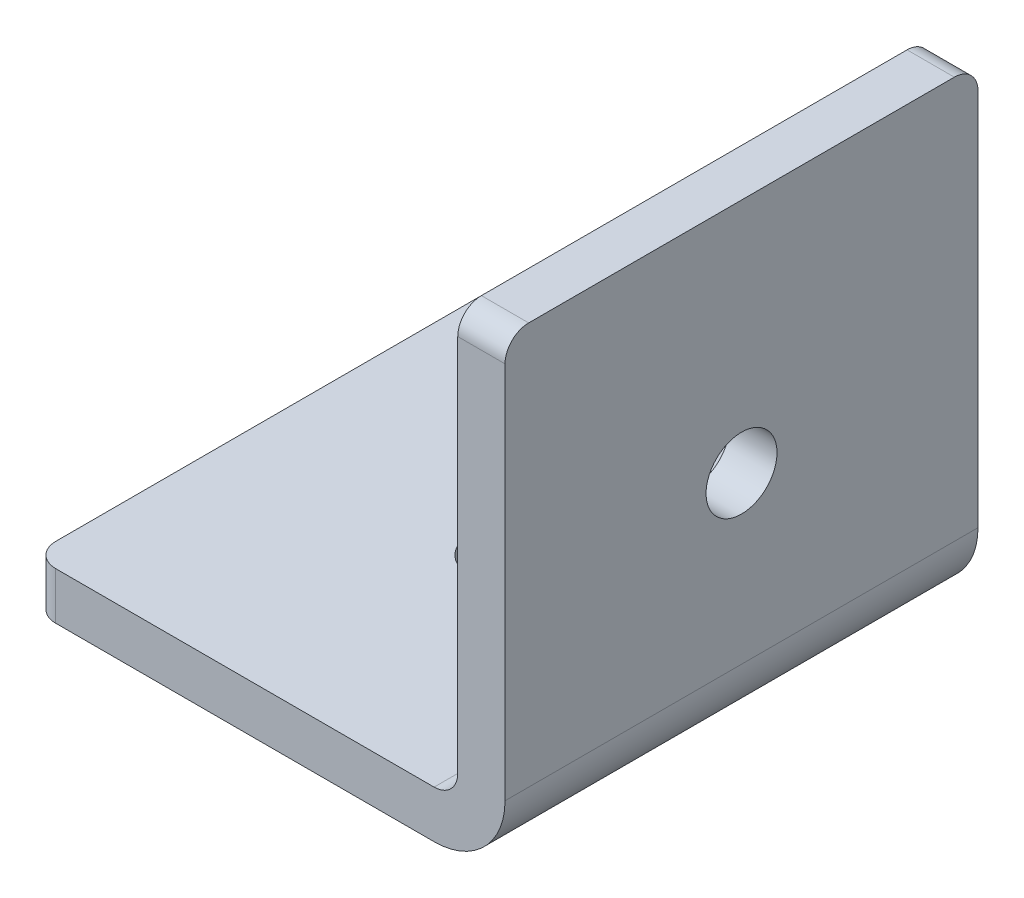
ISO-10303-21;
HEADER;
FILE_DESCRIPTION(('STEP AP214'),'2;1');
FILE_NAME('part.step','',(''),(''),'','','');
FILE_SCHEMA(('AUTOMOTIVE_DESIGN { 1 0 10303 214 1 1 1 1 }'));
ENDSEC;
DATA;
#1=APPLICATION_CONTEXT('core data for automotive mechanical design processes');
#2=APPLICATION_PROTOCOL_DEFINITION('international standard','automotive_design',2000,#1);
#3=PRODUCT_CONTEXT('',#1,'mechanical');
#4=PRODUCT('Part','Part','',(#3));
#5=PRODUCT_RELATED_PRODUCT_CATEGORY('part','',(#4));
#6=PRODUCT_DEFINITION_FORMATION('','',#4);
#7=PRODUCT_DEFINITION_CONTEXT('part definition',#1,'design');
#8=PRODUCT_DEFINITION('design','',#6,#7);
#9=PRODUCT_DEFINITION_SHAPE('','',#8);
#10=(LENGTH_UNIT() NAMED_UNIT(*) SI_UNIT(.MILLI.,.METRE.));
#11=(NAMED_UNIT(*) PLANE_ANGLE_UNIT() SI_UNIT($,.RADIAN.));
#12=(NAMED_UNIT(*) SI_UNIT($,.STERADIAN.) SOLID_ANGLE_UNIT());
#13=UNCERTAINTY_MEASURE_WITH_UNIT(LENGTH_MEASURE(1.E-05),#10,'distance_accuracy_value','');
#14=(GEOMETRIC_REPRESENTATION_CONTEXT(3) GLOBAL_UNCERTAINTY_ASSIGNED_CONTEXT((#13)) GLOBAL_UNIT_ASSIGNED_CONTEXT((#10,
#11,#12)) REPRESENTATION_CONTEXT('',''));
#15=CARTESIAN_POINT('',(0.,0.,0.));
#16=DIRECTION('',(0.,0.,1.));
#17=DIRECTION('',(1.,0.,0.));
#18=AXIS2_PLACEMENT_3D('',#15,#16,#17);
#19=CARTESIAN_POINT('',(40.,0.,40.));
#20=DIRECTION('',(-1.,0.,0.));
#21=DIRECTION('',(0.,0.,1.));
#22=AXIS2_PLACEMENT_3D('',#19,#20,#21);
#23=PLANE('',#22);
#24=CARTESIAN_POINT('',(40.,20.,20.));
#25=DIRECTION('',(1.,0.,0.));
#26=DIRECTION('',(0.,0.,-1.));
#27=AXIS2_PLACEMENT_3D('',#24,#25,#26);
#28=CIRCLE('',#27,3.);
#29=CARTESIAN_POINT('',(40.,20.,17.));
#30=VERTEX_POINT('',#29);
#31=EDGE_CURVE('E204',#30,#30,#28,.T.);
#32=ORIENTED_EDGE('',*,*,#31,.F.);
#33=EDGE_LOOP('',(#32));
#34=FACE_BOUND('',#33,.T.);
#35=DIRECTION('',(0.,1.,0.));
#36=VECTOR('',#35,1.);
#37=CARTESIAN_POINT('',(40.,0.,40.));
#38=LINE('',#37,#36);
#39=CARTESIAN_POINT('',(40.,6.,40.));
#40=VERTEX_POINT('',#39);
#41=CARTESIAN_POINT('',(40.,38.,40.));
#42=VERTEX_POINT('',#41);
#43=EDGE_CURVE('E193',#40,#42,#38,.T.);
#44=ORIENTED_EDGE('',*,*,#43,.F.);
#45=DIRECTION('',(0.,0.,-1.));
#46=VECTOR('',#45,1.);
#47=CARTESIAN_POINT('',(40.,6.,40.));
#48=LINE('',#47,#46);
#49=CARTESIAN_POINT('',(40.,6.,0.));
#50=VERTEX_POINT('',#49);
#51=EDGE_CURVE('E184',#40,#50,#48,.T.);
#52=ORIENTED_EDGE('',*,*,#51,.T.);
#53=DIRECTION('',(0.,1.,0.));
#54=VECTOR('',#53,1.);
#55=CARTESIAN_POINT('',(40.,0.,0.));
#56=LINE('',#55,#54);
#57=CARTESIAN_POINT('',(40.,38.,0.));
#58=VERTEX_POINT('',#57);
#59=EDGE_CURVE('E191',#50,#58,#56,.T.);
#60=ORIENTED_EDGE('',*,*,#59,.T.);
#61=CARTESIAN_POINT('',(40.,38.,2.));
#62=DIRECTION('',(-1.,0.,0.));
#63=DIRECTION('',(0.,0.,1.));
#64=AXIS2_PLACEMENT_3D('',#61,#62,#63);
#65=CIRCLE('',#64,2.);
#66=CARTESIAN_POINT('',(40.,40.,2.));
#67=VERTEX_POINT('',#66);
#68=EDGE_CURVE('E145',#58,#67,#65,.F.);
#69=ORIENTED_EDGE('',*,*,#68,.T.);
#70=DIRECTION('',(0.,0.,-1.));
#71=VECTOR('',#70,1.);
#72=CARTESIAN_POINT('',(40.,40.,40.));
#73=LINE('',#72,#71);
#74=CARTESIAN_POINT('',(40.,40.,38.));
#75=VERTEX_POINT('',#74);
#76=EDGE_CURVE('E139',#75,#67,#73,.T.);
#77=ORIENTED_EDGE('',*,*,#76,.F.);
#78=CARTESIAN_POINT('',(40.,38.,38.));
#79=DIRECTION('',(-1.,0.,0.));
#80=DIRECTION('',(0.,0.,1.));
#81=AXIS2_PLACEMENT_3D('',#78,#79,#80);
#82=CIRCLE('',#81,2.);
#83=EDGE_CURVE('E144',#75,#42,#82,.F.);
#84=ORIENTED_EDGE('',*,*,#83,.T.);
#85=EDGE_LOOP('',(#44,#52,#60,#69,#77,#84));
#86=FACE_BOUND('',#85,.T.);
#87=ADVANCED_FACE('F28',(#34,#86),#23,.F.);
#88=CARTESIAN_POINT('',(36.,40.,40.));
#89=DIRECTION('',(0.,1.,0.));
#90=DIRECTION('',(0.,0.,1.));
#91=AXIS2_PLACEMENT_3D('',#88,#89,#90);
#92=PLANE('',#91);
#93=DIRECTION('',(0.,0.,-1.));
#94=VECTOR('',#93,1.);
#95=CARTESIAN_POINT('',(36.,40.,40.));
#96=LINE('',#95,#94);
#97=CARTESIAN_POINT('',(36.,40.,38.));
#98=VERTEX_POINT('',#97);
#99=CARTESIAN_POINT('',(36.,40.,2.));
#100=VERTEX_POINT('',#99);
#101=EDGE_CURVE('E121',#98,#100,#96,.T.);
#102=ORIENTED_EDGE('',*,*,#101,.F.);
#103=DIRECTION('',(1.,0.,0.));
#104=VECTOR('',#103,1.);
#105=CARTESIAN_POINT('',(36.,40.,38.));
#106=LINE('',#105,#104);
#107=EDGE_CURVE('E135',#98,#75,#106,.T.);
#108=ORIENTED_EDGE('',*,*,#107,.T.);
#109=ORIENTED_EDGE('',*,*,#76,.T.);
#110=DIRECTION('',(1.,0.,0.));
#111=VECTOR('',#110,1.);
#112=CARTESIAN_POINT('',(36.,40.,2.));
#113=LINE('',#112,#111);
#114=EDGE_CURVE('E138',#67,#100,#113,.F.);
#115=ORIENTED_EDGE('',*,*,#114,.T.);
#116=EDGE_LOOP('',(#102,#108,#109,#115));
#117=FACE_BOUND('',#116,.T.);
#118=ADVANCED_FACE('F133',(#117),#92,.T.);
#119=CARTESIAN_POINT('',(36.,0.,40.));
#120=DIRECTION('',(-1.,0.,0.));
#121=DIRECTION('',(0.,0.,1.));
#122=AXIS2_PLACEMENT_3D('',#119,#120,#121);
#123=PLANE('',#122);
#124=CARTESIAN_POINT('',(36.,20.,20.));
#125=DIRECTION('',(-1.,0.,0.));
#126=DIRECTION('',(0.,0.,1.));
#127=AXIS2_PLACEMENT_3D('',#124,#125,#126);
#128=CIRCLE('',#127,3.);
#129=CARTESIAN_POINT('',(36.,20.,23.));
#130=VERTEX_POINT('',#129);
#131=EDGE_CURVE('E31',#130,#130,#128,.T.);
#132=ORIENTED_EDGE('',*,*,#131,.F.);
#133=EDGE_LOOP('',(#132));
#134=FACE_BOUND('',#133,.T.);
#135=DIRECTION('',(0.,1.,0.));
#136=VECTOR('',#135,1.);
#137=CARTESIAN_POINT('',(36.,0.,40.));
#138=LINE('',#137,#136);
#139=CARTESIAN_POINT('',(36.,6.,40.));
#140=VERTEX_POINT('',#139);
#141=CARTESIAN_POINT('',(36.,38.,40.));
#142=VERTEX_POINT('',#141);
#143=EDGE_CURVE('E124',#140,#142,#138,.T.);
#144=ORIENTED_EDGE('',*,*,#143,.T.);
#145=CARTESIAN_POINT('',(36.,38.,38.));
#146=DIRECTION('',(-1.,0.,0.));
#147=DIRECTION('',(0.,0.,1.));
#148=AXIS2_PLACEMENT_3D('',#145,#146,#147);
#149=CIRCLE('',#148,2.);
#150=EDGE_CURVE('E118',#142,#98,#149,.T.);
#151=ORIENTED_EDGE('',*,*,#150,.T.);
#152=ORIENTED_EDGE('',*,*,#101,.T.);
#153=CARTESIAN_POINT('',(36.,38.,2.));
#154=DIRECTION('',(-1.,0.,0.));
#155=DIRECTION('',(0.,0.,1.));
#156=AXIS2_PLACEMENT_3D('',#153,#154,#155);
#157=CIRCLE('',#156,2.);
#158=CARTESIAN_POINT('',(36.,38.,0.));
#159=VERTEX_POINT('',#158);
#160=EDGE_CURVE('E129',#100,#159,#157,.T.);
#161=ORIENTED_EDGE('',*,*,#160,.T.);
#162=DIRECTION('',(0.,1.,0.));
#163=VECTOR('',#162,1.);
#164=CARTESIAN_POINT('',(36.,0.,0.));
#165=LINE('',#164,#163);
#166=CARTESIAN_POINT('',(36.,6.,0.));
#167=VERTEX_POINT('',#166);
#168=EDGE_CURVE('E199',#167,#159,#165,.T.);
#169=ORIENTED_EDGE('',*,*,#168,.F.);
#170=DIRECTION('',(0.,0.,-1.));
#171=VECTOR('',#170,1.);
#172=CARTESIAN_POINT('',(36.,6.,40.));
#173=LINE('',#172,#171);
#174=EDGE_CURVE('E156',#167,#140,#173,.F.);
#175=ORIENTED_EDGE('',*,*,#174,.T.);
#176=EDGE_LOOP('',(#144,#151,#152,#161,#169,#175));
#177=FACE_BOUND('',#176,.T.);
#178=ADVANCED_FACE('F120',(#134,#177),#123,.T.);
#179=CARTESIAN_POINT('',(0.,4.,40.));
#180=DIRECTION('',(0.,1.,0.));
#181=DIRECTION('',(0.,0.,1.));
#182=AXIS2_PLACEMENT_3D('',#179,#180,#181);
#183=PLANE('',#182);
#184=CARTESIAN_POINT('',(20.,4.,20.));
#185=DIRECTION('',(0.,1.,0.));
#186=DIRECTION('',(0.,0.,1.));
#187=AXIS2_PLACEMENT_3D('',#184,#185,#186);
#188=CIRCLE('',#187,3.);
#189=CARTESIAN_POINT('',(20.,4.,23.));
#190=VERTEX_POINT('',#189);
#191=EDGE_CURVE('E274',#190,#190,#188,.T.);
#192=ORIENTED_EDGE('',*,*,#191,.F.);
#193=EDGE_LOOP('',(#192));
#194=FACE_BOUND('',#193,.T.);
#195=DIRECTION('',(0.,0.,-1.));
#196=VECTOR('',#195,1.);
#197=CARTESIAN_POINT('',(0.,4.,40.));
#198=LINE('',#197,#196);
#199=CARTESIAN_POINT('',(0.,4.,38.));
#200=VERTEX_POINT('',#199);
#201=CARTESIAN_POINT('',(0.,4.,2.));
#202=VERTEX_POINT('',#201);
#203=EDGE_CURVE('E140',#200,#202,#198,.T.);
#204=ORIENTED_EDGE('',*,*,#203,.F.);
#205=CARTESIAN_POINT('',(2.,4.,38.));
#206=DIRECTION('',(0.,1.,0.));
#207=DIRECTION('',(0.,0.,1.));
#208=AXIS2_PLACEMENT_3D('',#205,#206,#207);
#209=CIRCLE('',#208,2.);
#210=CARTESIAN_POINT('',(2.,4.,40.));
#211=VERTEX_POINT('',#210);
#212=EDGE_CURVE('E174',#200,#211,#209,.T.);
#213=ORIENTED_EDGE('',*,*,#212,.T.);
#214=DIRECTION('',(1.,0.,0.));
#215=VECTOR('',#214,1.);
#216=CARTESIAN_POINT('',(0.,4.,40.));
#217=LINE('',#216,#215);
#218=CARTESIAN_POINT('',(34.,4.,40.));
#219=VERTEX_POINT('',#218);
#220=EDGE_CURVE('E214',#211,#219,#217,.T.);
#221=ORIENTED_EDGE('',*,*,#220,.T.);
#222=DIRECTION('',(0.,0.,-1.));
#223=VECTOR('',#222,1.);
#224=CARTESIAN_POINT('',(34.,4.,40.));
#225=LINE('',#224,#223);
#226=CARTESIAN_POINT('',(34.,4.,0.));
#227=VERTEX_POINT('',#226);
#228=EDGE_CURVE('E169',#219,#227,#225,.T.);
#229=ORIENTED_EDGE('',*,*,#228,.T.);
#230=DIRECTION('',(1.,0.,0.));
#231=VECTOR('',#230,1.);
#232=CARTESIAN_POINT('',(0.,4.,0.));
#233=LINE('',#232,#231);
#234=CARTESIAN_POINT('',(2.,4.,0.));
#235=VERTEX_POINT('',#234);
#236=EDGE_CURVE('E201',#235,#227,#233,.T.);
#237=ORIENTED_EDGE('',*,*,#236,.F.);
#238=CARTESIAN_POINT('',(2.,4.,2.));
#239=DIRECTION('',(0.,1.,0.));
#240=DIRECTION('',(0.,0.,1.));
#241=AXIS2_PLACEMENT_3D('',#238,#239,#240);
#242=CIRCLE('',#241,2.);
#243=EDGE_CURVE('E172',#235,#202,#242,.T.);
#244=ORIENTED_EDGE('',*,*,#243,.T.);
#245=EDGE_LOOP('',(#204,#213,#221,#229,#237,#244));
#246=FACE_BOUND('',#245,.T.);
#247=ADVANCED_FACE('F234',(#194,#246),#183,.T.);
#248=CARTESIAN_POINT('',(0.,0.,40.));
#249=DIRECTION('',(-1.,0.,0.));
#250=DIRECTION('',(0.,0.,1.));
#251=AXIS2_PLACEMENT_3D('',#248,#249,#250);
#252=PLANE('',#251);
#253=DIRECTION('',(0.,0.,-1.));
#254=VECTOR('',#253,1.);
#255=CARTESIAN_POINT('',(0.,0.,40.));
#256=LINE('',#255,#254);
#257=CARTESIAN_POINT('',(0.,0.,38.));
#258=VERTEX_POINT('',#257);
#259=CARTESIAN_POINT('',(0.,0.,2.));
#260=VERTEX_POINT('',#259);
#261=EDGE_CURVE('E219',#258,#260,#256,.T.);
#262=ORIENTED_EDGE('',*,*,#261,.F.);
#263=DIRECTION('',(0.,1.,0.));
#264=VECTOR('',#263,1.);
#265=CARTESIAN_POINT('',(0.,0.,38.));
#266=LINE('',#265,#264);
#267=EDGE_CURVE('E166',#258,#200,#266,.T.);
#268=ORIENTED_EDGE('',*,*,#267,.T.);
#269=ORIENTED_EDGE('',*,*,#203,.T.);
#270=DIRECTION('',(0.,1.,0.));
#271=VECTOR('',#270,1.);
#272=CARTESIAN_POINT('',(0.,0.,2.));
#273=LINE('',#272,#271);
#274=EDGE_CURVE('E164',#202,#260,#273,.F.);
#275=ORIENTED_EDGE('',*,*,#274,.T.);
#276=EDGE_LOOP('',(#262,#268,#269,#275));
#277=FACE_BOUND('',#276,.T.);
#278=ADVANCED_FACE('F247',(#277),#252,.T.);
#279=CARTESIAN_POINT('',(0.,0.,40.));
#280=DIRECTION('',(0.,1.,0.));
#281=DIRECTION('',(0.,0.,1.));
#282=AXIS2_PLACEMENT_3D('',#279,#280,#281);
#283=PLANE('',#282);
#284=CARTESIAN_POINT('',(20.,0.,20.));
#285=DIRECTION('',(0.,1.,0.));
#286=DIRECTION('',(0.,0.,1.));
#287=AXIS2_PLACEMENT_3D('',#284,#285,#286);
#288=CIRCLE('',#287,3.);
#289=CARTESIAN_POINT('',(20.,0.,23.));
#290=VERTEX_POINT('',#289);
#291=EDGE_CURVE('E272',#290,#290,#288,.T.);
#292=ORIENTED_EDGE('',*,*,#291,.T.);
#293=EDGE_LOOP('',(#292));
#294=FACE_BOUND('',#293,.T.);
#295=DIRECTION('',(1.,0.,0.));
#296=VECTOR('',#295,1.);
#297=CARTESIAN_POINT('',(0.,0.,0.));
#298=LINE('',#297,#296);
#299=CARTESIAN_POINT('',(2.,0.,0.));
#300=VERTEX_POINT('',#299);
#301=CARTESIAN_POINT('',(34.,0.,0.));
#302=VERTEX_POINT('',#301);
#303=EDGE_CURVE('E210',#300,#302,#298,.T.);
#304=ORIENTED_EDGE('',*,*,#303,.T.);
#305=DIRECTION('',(0.,0.,-1.));
#306=VECTOR('',#305,1.);
#307=CARTESIAN_POINT('',(34.,0.,40.));
#308=LINE('',#307,#306);
#309=CARTESIAN_POINT('',(34.,0.,40.));
#310=VERTEX_POINT('',#309);
#311=EDGE_CURVE('E36',#302,#310,#308,.F.);
#312=ORIENTED_EDGE('',*,*,#311,.T.);
#313=DIRECTION('',(1.,0.,0.));
#314=VECTOR('',#313,1.);
#315=CARTESIAN_POINT('',(0.,0.,40.));
#316=LINE('',#315,#314);
#317=CARTESIAN_POINT('',(2.,0.,40.));
#318=VERTEX_POINT('',#317);
#319=EDGE_CURVE('E217',#318,#310,#316,.T.);
#320=ORIENTED_EDGE('',*,*,#319,.F.);
#321=CARTESIAN_POINT('',(2.,0.,38.));
#322=DIRECTION('',(0.,1.,0.));
#323=DIRECTION('',(0.,0.,1.));
#324=AXIS2_PLACEMENT_3D('',#321,#322,#323);
#325=CIRCLE('',#324,2.);
#326=EDGE_CURVE('E178',#318,#258,#325,.F.);
#327=ORIENTED_EDGE('',*,*,#326,.T.);
#328=ORIENTED_EDGE('',*,*,#261,.T.);
#329=CARTESIAN_POINT('',(2.,0.,2.));
#330=DIRECTION('',(0.,1.,0.));
#331=DIRECTION('',(0.,0.,1.));
#332=AXIS2_PLACEMENT_3D('',#329,#330,#331);
#333=CIRCLE('',#332,2.);
#334=EDGE_CURVE('E176',#260,#300,#333,.F.);
#335=ORIENTED_EDGE('',*,*,#334,.T.);
#336=EDGE_LOOP('',(#304,#312,#320,#327,#328,#335));
#337=FACE_BOUND('',#336,.T.);
#338=ADVANCED_FACE('F244',(#294,#337),#283,.F.);
#339=CARTESIAN_POINT('',(40.,40.,40.));
#340=DIRECTION('',(0.,0.,-1.));
#341=DIRECTION('',(-1.,0.,0.));
#342=AXIS2_PLACEMENT_3D('',#339,#340,#341);
#343=PLANE('',#342);
#344=ORIENTED_EDGE('',*,*,#319,.T.);
#345=CARTESIAN_POINT('',(34.,6.,40.));
#346=DIRECTION('',(0.,0.,-1.));
#347=DIRECTION('',(-1.,0.,0.));
#348=AXIS2_PLACEMENT_3D('',#345,#346,#347);
#349=CIRCLE('',#348,6.);
#350=EDGE_CURVE('E11',#310,#40,#349,.F.);
#351=ORIENTED_EDGE('',*,*,#350,.T.);
#352=ORIENTED_EDGE('',*,*,#43,.T.);
#353=DIRECTION('',(1.,0.,0.));
#354=VECTOR('',#353,1.);
#355=CARTESIAN_POINT('',(36.,38.,40.));
#356=LINE('',#355,#354);
#357=EDGE_CURVE('E154',#42,#142,#356,.F.);
#358=ORIENTED_EDGE('',*,*,#357,.T.);
#359=ORIENTED_EDGE('',*,*,#143,.F.);
#360=CARTESIAN_POINT('',(34.,6.,40.));
#361=DIRECTION('',(0.,0.,-1.));
#362=DIRECTION('',(-1.,0.,0.));
#363=AXIS2_PLACEMENT_3D('',#360,#361,#362);
#364=CIRCLE('',#363,2.);
#365=EDGE_CURVE('E182',#140,#219,#364,.T.);
#366=ORIENTED_EDGE('',*,*,#365,.T.);
#367=ORIENTED_EDGE('',*,*,#220,.F.);
#368=DIRECTION('',(0.,1.,0.));
#369=VECTOR('',#368,1.);
#370=CARTESIAN_POINT('',(2.,0.,40.));
#371=LINE('',#370,#369);
#372=EDGE_CURVE('E152',#211,#318,#371,.F.);
#373=ORIENTED_EDGE('',*,*,#372,.T.);
#374=EDGE_LOOP('',(#344,#351,#352,#358,#359,#366,#367,#373));
#375=FACE_BOUND('',#374,.T.);
#376=ADVANCED_FACE('F238',(#375),#343,.F.);
#377=CARTESIAN_POINT('',(40.,40.,0.));
#378=DIRECTION('',(0.,0.,-1.));
#379=DIRECTION('',(-1.,0.,0.));
#380=AXIS2_PLACEMENT_3D('',#377,#378,#379);
#381=PLANE('',#380);
#382=ORIENTED_EDGE('',*,*,#59,.F.);
#383=CARTESIAN_POINT('',(34.,6.,0.));
#384=DIRECTION('',(0.,0.,-1.));
#385=DIRECTION('',(-1.,0.,0.));
#386=AXIS2_PLACEMENT_3D('',#383,#384,#385);
#387=CIRCLE('',#386,6.);
#388=EDGE_CURVE('E50',#50,#302,#387,.T.);
#389=ORIENTED_EDGE('',*,*,#388,.T.);
#390=ORIENTED_EDGE('',*,*,#303,.F.);
#391=DIRECTION('',(0.,1.,0.));
#392=VECTOR('',#391,1.);
#393=CARTESIAN_POINT('',(2.,40.,0.));
#394=LINE('',#393,#392);
#395=EDGE_CURVE('E128',#300,#235,#394,.T.);
#396=ORIENTED_EDGE('',*,*,#395,.T.);
#397=ORIENTED_EDGE('',*,*,#236,.T.);
#398=CARTESIAN_POINT('',(34.,6.,0.));
#399=DIRECTION('',(0.,0.,-1.));
#400=DIRECTION('',(-1.,0.,0.));
#401=AXIS2_PLACEMENT_3D('',#398,#399,#400);
#402=CIRCLE('',#401,2.);
#403=EDGE_CURVE('E180',#227,#167,#402,.F.);
#404=ORIENTED_EDGE('',*,*,#403,.T.);
#405=ORIENTED_EDGE('',*,*,#168,.T.);
#406=DIRECTION('',(1.,0.,0.));
#407=VECTOR('',#406,1.);
#408=CARTESIAN_POINT('',(40.,38.,0.));
#409=LINE('',#408,#407);
#410=EDGE_CURVE('E161',#159,#58,#409,.T.);
#411=ORIENTED_EDGE('',*,*,#410,.T.);
#412=EDGE_LOOP('',(#382,#389,#390,#396,#397,#404,#405,#411));
#413=FACE_BOUND('',#412,.T.);
#414=ADVANCED_FACE('F196',(#413),#381,.T.);
#415=CARTESIAN_POINT('',(36.,38.,38.));
#416=DIRECTION('',(-1.,0.,0.));
#417=DIRECTION('',(0.,0.,1.));
#418=AXIS2_PLACEMENT_3D('',#415,#416,#417);
#419=CYLINDRICAL_SURFACE('',#418,2.);
#420=ORIENTED_EDGE('',*,*,#150,.F.);
#421=ORIENTED_EDGE('',*,*,#357,.F.);
#422=ORIENTED_EDGE('',*,*,#83,.F.);
#423=ORIENTED_EDGE('',*,*,#107,.F.);
#424=EDGE_LOOP('',(#420,#421,#422,#423));
#425=FACE_BOUND('',#424,.T.);
#426=ADVANCED_FACE('F142',(#425),#419,.T.);
#427=CARTESIAN_POINT('',(40.,38.,2.));
#428=DIRECTION('',(1.,0.,0.));
#429=DIRECTION('',(0.,0.,-1.));
#430=AXIS2_PLACEMENT_3D('',#427,#428,#429);
#431=CYLINDRICAL_SURFACE('',#430,2.);
#432=ORIENTED_EDGE('',*,*,#160,.F.);
#433=ORIENTED_EDGE('',*,*,#114,.F.);
#434=ORIENTED_EDGE('',*,*,#68,.F.);
#435=ORIENTED_EDGE('',*,*,#410,.F.);
#436=EDGE_LOOP('',(#432,#433,#434,#435));
#437=FACE_BOUND('',#436,.T.);
#438=ADVANCED_FACE('F224',(#437),#431,.T.);
#439=CARTESIAN_POINT('',(2.,0.,38.));
#440=DIRECTION('',(0.,-1.,0.));
#441=DIRECTION('',(0.,0.,-1.));
#442=AXIS2_PLACEMENT_3D('',#439,#440,#441);
#443=CYLINDRICAL_SURFACE('',#442,2.);
#444=ORIENTED_EDGE('',*,*,#326,.F.);
#445=ORIENTED_EDGE('',*,*,#372,.F.);
#446=ORIENTED_EDGE('',*,*,#212,.F.);
#447=ORIENTED_EDGE('',*,*,#267,.F.);
#448=EDGE_LOOP('',(#444,#445,#446,#447));
#449=FACE_BOUND('',#448,.T.);
#450=ADVANCED_FACE('F241',(#449),#443,.T.);
#451=CARTESIAN_POINT('',(2.,40.,2.));
#452=DIRECTION('',(0.,1.,0.));
#453=DIRECTION('',(0.,0.,1.));
#454=AXIS2_PLACEMENT_3D('',#451,#452,#453);
#455=CYLINDRICAL_SURFACE('',#454,2.);
#456=ORIENTED_EDGE('',*,*,#334,.F.);
#457=ORIENTED_EDGE('',*,*,#274,.F.);
#458=ORIENTED_EDGE('',*,*,#243,.F.);
#459=ORIENTED_EDGE('',*,*,#395,.F.);
#460=EDGE_LOOP('',(#456,#457,#458,#459));
#461=FACE_BOUND('',#460,.T.);
#462=ADVANCED_FACE('F250',(#461),#455,.T.);
#463=CARTESIAN_POINT('',(34.,6.,40.));
#464=DIRECTION('',(0.,0.,1.));
#465=DIRECTION('',(1.,0.,0.));
#466=AXIS2_PLACEMENT_3D('',#463,#464,#465);
#467=CYLINDRICAL_SURFACE('',#466,2.);
#468=ORIENTED_EDGE('',*,*,#365,.F.);
#469=ORIENTED_EDGE('',*,*,#174,.F.);
#470=ORIENTED_EDGE('',*,*,#403,.F.);
#471=ORIENTED_EDGE('',*,*,#228,.F.);
#472=EDGE_LOOP('',(#468,#469,#470,#471));
#473=FACE_BOUND('',#472,.T.);
#474=ADVANCED_FACE('F231',(#473),#467,.F.);
#475=CARTESIAN_POINT('',(34.,6.,40.));
#476=DIRECTION('',(0.,0.,-1.));
#477=DIRECTION('',(-1.,0.,0.));
#478=AXIS2_PLACEMENT_3D('',#475,#476,#477);
#479=CYLINDRICAL_SURFACE('',#478,6.);
#480=ORIENTED_EDGE('',*,*,#350,.F.);
#481=ORIENTED_EDGE('',*,*,#311,.F.);
#482=ORIENTED_EDGE('',*,*,#388,.F.);
#483=ORIENTED_EDGE('',*,*,#51,.F.);
#484=EDGE_LOOP('',(#480,#481,#482,#483));
#485=FACE_BOUND('',#484,.T.);
#486=ADVANCED_FACE('F252',(#485),#479,.T.);
#487=CARTESIAN_POINT('',(0.,20.,20.));
#488=DIRECTION('',(1.,0.,0.));
#489=DIRECTION('',(0.,0.,-1.));
#490=AXIS2_PLACEMENT_3D('',#487,#488,#489);
#491=CYLINDRICAL_SURFACE('',#490,3.);
#492=ORIENTED_EDGE('',*,*,#131,.T.);
#493=EDGE_LOOP('',(#492));
#494=FACE_BOUND('',#493,.T.);
#495=ORIENTED_EDGE('',*,*,#31,.T.);
#496=EDGE_LOOP('',(#495));
#497=FACE_BOUND('',#496,.T.);
#498=ADVANCED_FACE('F254',(#494,#497),#491,.F.);
#499=CARTESIAN_POINT('',(20.,0.,20.));
#500=DIRECTION('',(0.,1.,0.));
#501=DIRECTION('',(0.,0.,1.));
#502=AXIS2_PLACEMENT_3D('',#499,#500,#501);
#503=CYLINDRICAL_SURFACE('',#502,3.);
#504=ORIENTED_EDGE('',*,*,#291,.F.);
#505=EDGE_LOOP('',(#504));
#506=FACE_BOUND('',#505,.T.);
#507=ORIENTED_EDGE('',*,*,#191,.T.);
#508=EDGE_LOOP('',(#507));
#509=FACE_BOUND('',#508,.T.);
#510=ADVANCED_FACE('F260',(#506,#509),#503,.F.);
#511=CLOSED_SHELL('',(#87,#118,#178,#247,#278,#338,#376,#414,#426,#438,#450,#462,#474,#486,#498,#510));
#512=MANIFOLD_SOLID_BREP('B2',#511);
#513=ADVANCED_BREP_SHAPE_REPRESENTATION('',(#18,#512),#14);
#514=SHAPE_DEFINITION_REPRESENTATION(#9,#513);
ENDSEC;
END-ISO-10303-21;
